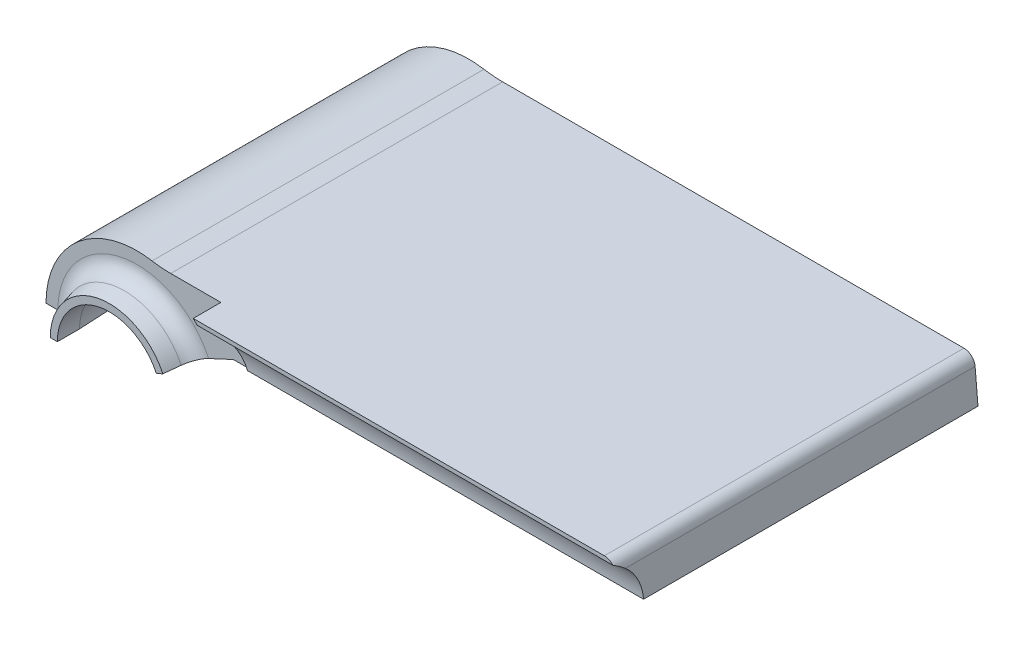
ISO-10303-21;
HEADER;
FILE_DESCRIPTION(('STEP AP214'),'2;1');
FILE_NAME('part.step','',(''),(''),'','','');
FILE_SCHEMA(('AUTOMOTIVE_DESIGN { 1 0 10303 214 1 1 1 1 }'));
ENDSEC;
DATA;
#1=APPLICATION_CONTEXT('core data for automotive mechanical design processes');
#2=APPLICATION_PROTOCOL_DEFINITION('international standard','automotive_design',2000,#1);
#3=PRODUCT_CONTEXT('',#1,'mechanical');
#4=PRODUCT('Part','Part','',(#3));
#5=PRODUCT_RELATED_PRODUCT_CATEGORY('part','',(#4));
#6=PRODUCT_DEFINITION_FORMATION('','',#4);
#7=PRODUCT_DEFINITION_CONTEXT('part definition',#1,'design');
#8=PRODUCT_DEFINITION('design','',#6,#7);
#9=PRODUCT_DEFINITION_SHAPE('','',#8);
#10=(LENGTH_UNIT() NAMED_UNIT(*) SI_UNIT(.MILLI.,.METRE.));
#11=(NAMED_UNIT(*) PLANE_ANGLE_UNIT() SI_UNIT($,.RADIAN.));
#12=(NAMED_UNIT(*) SI_UNIT($,.STERADIAN.) SOLID_ANGLE_UNIT());
#13=UNCERTAINTY_MEASURE_WITH_UNIT(LENGTH_MEASURE(1.E-05),#10,'distance_accuracy_value','');
#14=(GEOMETRIC_REPRESENTATION_CONTEXT(3) GLOBAL_UNCERTAINTY_ASSIGNED_CONTEXT((#13)) GLOBAL_UNIT_ASSIGNED_CONTEXT((#10,
#11,#12)) REPRESENTATION_CONTEXT('',''));
#15=CARTESIAN_POINT('',(0.,0.,0.));
#16=DIRECTION('',(0.,0.,1.));
#17=DIRECTION('',(1.,0.,0.));
#18=AXIS2_PLACEMENT_3D('',#15,#16,#17);
#19=CARTESIAN_POINT('',(6.10080322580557,15.935,65.));
#20=DIRECTION('',(0.,-1.,0.));
#21=DIRECTION('',(0.,0.,-1.));
#22=AXIS2_PLACEMENT_3D('',#19,#20,#21);
#23=PLANE('',#22);
#24=DIRECTION('',(0.,0.,-1.));
#25=VECTOR('',#24,1.);
#26=CARTESIAN_POINT('',(15.1682489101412,15.935,-7.82372390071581));
#27=LINE('',#26,#25);
#28=CARTESIAN_POINT('',(15.1682489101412,15.935,65.));
#29=VERTEX_POINT('',#28);
#30=CARTESIAN_POINT('',(15.1682489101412,15.935,60.));
#31=VERTEX_POINT('',#30);
#32=EDGE_CURVE('E273',#29,#31,#27,.T.);
#33=ORIENTED_EDGE('',*,*,#32,.F.);
#34=DIRECTION('',(-1.,0.,0.));
#35=VECTOR('',#34,1.);
#36=CARTESIAN_POINT('',(6.10080322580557,15.935,65.));
#37=LINE('',#36,#35);
#38=CARTESIAN_POINT('',(89.4898477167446,15.935,65.));
#39=VERTEX_POINT('',#38);
#40=EDGE_CURVE('E295',#39,#29,#37,.T.);
#41=ORIENTED_EDGE('',*,*,#40,.F.);
#42=DIRECTION('',(0.,0.,-1.));
#43=VECTOR('',#42,1.);
#44=CARTESIAN_POINT('',(89.4898477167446,15.935,65.));
#45=LINE('',#44,#43);
#46=CARTESIAN_POINT('',(89.4898477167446,15.935,0.));
#47=VERTEX_POINT('',#46);
#48=EDGE_CURVE('E302',#39,#47,#45,.T.);
#49=ORIENTED_EDGE('',*,*,#48,.T.);
#50=DIRECTION('',(-1.,0.,0.));
#51=VECTOR('',#50,1.);
#52=CARTESIAN_POINT('',(6.10080322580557,15.935,0.));
#53=LINE('',#52,#51);
#54=CARTESIAN_POINT('',(6.10080322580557,15.935,0.));
#55=VERTEX_POINT('',#54);
#56=EDGE_CURVE('E284',#47,#55,#53,.T.);
#57=ORIENTED_EDGE('',*,*,#56,.T.);
#58=DIRECTION('',(0.,0.,-1.));
#59=VECTOR('',#58,1.);
#60=CARTESIAN_POINT('',(6.10080322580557,15.935,65.));
#61=LINE('',#60,#59);
#62=CARTESIAN_POINT('',(6.10080322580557,15.935,60.));
#63=VERTEX_POINT('',#62);
#64=EDGE_CURVE('E300',#63,#55,#61,.T.);
#65=ORIENTED_EDGE('',*,*,#64,.F.);
#66=DIRECTION('',(-1.,0.,0.));
#67=VECTOR('',#66,1.);
#68=CARTESIAN_POINT('',(6.10080322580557,15.935,60.));
#69=LINE('',#68,#67);
#70=EDGE_CURVE('E277',#31,#63,#69,.T.);
#71=ORIENTED_EDGE('',*,*,#70,.F.);
#72=EDGE_LOOP('',(#33,#41,#49,#57,#65,#71));
#73=FACE_BOUND('',#72,.T.);
#74=ADVANCED_FACE('F30',(#73),#23,.F.);
#75=CARTESIAN_POINT('',(6.10080322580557,36.235,65.));
#76=DIRECTION('',(0.,0.,-1.));
#77=DIRECTION('',(-1.,0.,0.));
#78=AXIS2_PLACEMENT_3D('',#75,#76,#77);
#79=CYLINDRICAL_SURFACE('',#78,20.3);
#80=CARTESIAN_POINT('',(6.10080322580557,36.235,60.));
#81=DIRECTION('',(0.,0.,1.));
#82=DIRECTION('',(1.,0.,0.));
#83=AXIS2_PLACEMENT_3D('',#80,#81,#82);
#84=CIRCLE('',#83,20.3);
#85=CARTESIAN_POINT('',(2.73037716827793,16.216752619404,60.));
#86=VERTEX_POINT('',#85);
#87=EDGE_CURVE('E275',#63,#86,#84,.F.);
#88=ORIENTED_EDGE('',*,*,#87,.F.);
#89=ORIENTED_EDGE('',*,*,#64,.T.);
#90=CARTESIAN_POINT('',(6.10080322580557,36.235,0.));
#91=DIRECTION('',(0.,0.,-1.));
#92=DIRECTION('',(1.,0.,0.));
#93=AXIS2_PLACEMENT_3D('',#90,#91,#92);
#94=CIRCLE('',#93,20.3);
#95=CARTESIAN_POINT('',(2.73037716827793,16.216752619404,0.));
#96=VERTEX_POINT('',#95);
#97=EDGE_CURVE('E287',#55,#96,#94,.T.);
#98=ORIENTED_EDGE('',*,*,#97,.T.);
#99=DIRECTION('',(0.,0.,-1.));
#100=VECTOR('',#99,1.);
#101=CARTESIAN_POINT('',(2.73037716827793,16.216752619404,65.));
#102=LINE('',#101,#100);
#103=EDGE_CURVE('E298',#86,#96,#102,.T.);
#104=ORIENTED_EDGE('',*,*,#103,.F.);
#105=EDGE_LOOP('',(#88,#89,#98,#104));
#106=FACE_BOUND('',#105,.T.);
#107=ADVANCED_FACE('F380',(#106),#79,.F.);
#108=CARTESIAN_POINT('',(0.,0.,65.));
#109=DIRECTION('',(0.,0.,-1.));
#110=DIRECTION('',(-1.,0.,0.));
#111=AXIS2_PLACEMENT_3D('',#108,#109,#110);
#112=CYLINDRICAL_SURFACE('',#111,16.445);
#113=CARTESIAN_POINT('',(0.,0.,0.));
#114=DIRECTION('',(0.,0.,1.));
#115=DIRECTION('',(1.,0.,0.));
#116=AXIS2_PLACEMENT_3D('',#113,#114,#115);
#117=CIRCLE('',#116,16.445);
#118=CARTESIAN_POINT('',(-16.445,0.,0.));
#119=VERTEX_POINT('',#118);
#120=EDGE_CURVE('E290',#96,#119,#117,.T.);
#121=ORIENTED_EDGE('',*,*,#120,.T.);
#122=DIRECTION('',(0.,0.,-1.));
#123=VECTOR('',#122,1.);
#124=CARTESIAN_POINT('',(-16.445,0.,65.));
#125=LINE('',#124,#123);
#126=CARTESIAN_POINT('',(-16.445,0.,60.));
#127=VERTEX_POINT('',#126);
#128=EDGE_CURVE('E207',#119,#127,#125,.F.);
#129=ORIENTED_EDGE('',*,*,#128,.T.);
#130=CARTESIAN_POINT('',(0.,0.,60.));
#131=DIRECTION('',(0.,0.,1.));
#132=DIRECTION('',(1.,0.,0.));
#133=AXIS2_PLACEMENT_3D('',#130,#131,#132);
#134=CIRCLE('',#133,16.445);
#135=EDGE_CURVE('E310',#86,#127,#134,.T.);
#136=ORIENTED_EDGE('',*,*,#135,.F.);
#137=ORIENTED_EDGE('',*,*,#103,.T.);
#138=EDGE_LOOP('',(#121,#129,#136,#137));
#139=FACE_BOUND('',#138,.T.);
#140=ADVANCED_FACE('F386',(#139),#112,.T.);
#141=CARTESIAN_POINT('',(30.8284770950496,-19.995,65.));
#142=DIRECTION('',(0.,0.,1.));
#143=DIRECTION('',(1.,0.,0.));
#144=AXIS2_PLACEMENT_3D('',#141,#142,#143);
#145=PLANE('',#144);
#146=DIRECTION('',(1.,0.,0.));
#147=VECTOR('',#146,1.);
#148=CARTESIAN_POINT('',(-16.446,15.2179803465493,65.));
#149=LINE('',#148,#147);
#150=CARTESIAN_POINT('',(15.8875131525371,15.2179803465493,65.));
#151=VERTEX_POINT('',#150);
#152=CARTESIAN_POINT('',(91.0380668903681,15.2179803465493,65.));
#153=VERTEX_POINT('',#152);
#154=EDGE_CURVE('E241',#151,#153,#149,.T.);
#155=ORIENTED_EDGE('',*,*,#154,.T.);
#156=CARTESIAN_POINT('',(89.4898477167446,13.905,65.));
#157=DIRECTION('',(0.,0.,1.));
#158=DIRECTION('',(-1.,0.,0.));
#159=AXIS2_PLACEMENT_3D('',#156,#157,#158);
#160=CIRCLE('',#159,2.03);
#161=EDGE_CURVE('E293',#153,#39,#160,.T.);
#162=ORIENTED_EDGE('',*,*,#161,.T.);
#163=ORIENTED_EDGE('',*,*,#40,.T.);
#164=CARTESIAN_POINT('',(0.,0.,65.));
#165=DIRECTION('',(0.,0.,-1.));
#166=DIRECTION('',(-1.,0.,0.));
#167=AXIS2_PLACEMENT_3D('',#164,#165,#166);
#168=CIRCLE('',#167,22.);
#169=EDGE_CURVE('E270',#29,#151,#168,.T.);
#170=ORIENTED_EDGE('',*,*,#169,.T.);
#171=EDGE_LOOP('',(#155,#162,#163,#170));
#172=FACE_BOUND('',#171,.T.);
#173=ADVANCED_FACE('F401',(#172),#145,.T.);
#174=CARTESIAN_POINT('',(91.5121229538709,14.0819261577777,65.));
#175=DIRECTION('',(-0.996194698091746,-0.0871557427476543,0.));
#176=DIRECTION('',(0.0871557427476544,-0.996194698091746,0.));
#177=AXIS2_PLACEMENT_3D('',#174,#175,#176);
#178=PLANE('',#177);
#179=DIRECTION('',(0.,0.,-1.));
#180=VECTOR('',#179,1.);
#181=CARTESIAN_POINT('',(91.5121229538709,14.0819261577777,65.));
#182=LINE('',#181,#180);
#183=CARTESIAN_POINT('',(91.5121229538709,14.0819261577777,63.2173114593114));
#184=VERTEX_POINT('',#183);
#185=CARTESIAN_POINT('',(91.5121229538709,14.0819261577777,0.));
#186=VERTEX_POINT('',#185);
#187=EDGE_CURVE('E305',#184,#186,#182,.T.);
#188=ORIENTED_EDGE('',*,*,#187,.F.);
#189=CARTESIAN_POINT('',(92.0337239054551,8.12,68.27));
#190=DIRECTION('',(-0.996194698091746,-0.0871557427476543,0.));
#191=DIRECTION('',(0.0871557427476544,-0.996194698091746,0.));
#192=AXIS2_PLACEMENT_3D('',#189,#190,#191);
#193=ELLIPSE('',#192,7.84485203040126,7.815);
#194=CARTESIAN_POINT('',(92.0337239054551,8.12,60.455));
#195=VERTEX_POINT('',#194);
#196=EDGE_CURVE('E238',#195,#184,#193,.F.);
#197=ORIENTED_EDGE('',*,*,#196,.F.);
#198=DIRECTION('',(0.,0.,-1.));
#199=VECTOR('',#198,1.);
#200=CARTESIAN_POINT('',(92.0337239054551,8.12,65.));
#201=LINE('',#200,#199);
#202=CARTESIAN_POINT('',(92.0337239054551,8.12,0.));
#203=VERTEX_POINT('',#202);
#204=EDGE_CURVE('E307',#195,#203,#201,.T.);
#205=ORIENTED_EDGE('',*,*,#204,.T.);
#206=DIRECTION('',(-0.0871557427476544,0.996194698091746,0.));
#207=VECTOR('',#206,1.);
#208=CARTESIAN_POINT('',(91.5121229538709,14.0819261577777,0.));
#209=LINE('',#208,#207);
#210=EDGE_CURVE('E279',#203,#186,#209,.T.);
#211=ORIENTED_EDGE('',*,*,#210,.T.);
#212=EDGE_LOOP('',(#188,#197,#205,#211));
#213=FACE_BOUND('',#212,.T.);
#214=ADVANCED_FACE('F32',(#213),#178,.F.);
#215=CARTESIAN_POINT('',(89.4898477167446,13.905,65.));
#216=DIRECTION('',(0.,0.,-1.));
#217=DIRECTION('',(-1.,0.,0.));
#218=AXIS2_PLACEMENT_3D('',#215,#216,#217);
#219=CYLINDRICAL_SURFACE('',#218,2.03);
#220=ORIENTED_EDGE('',*,*,#161,.F.);
#221=CARTESIAN_POINT('',(89.4898477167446,15.935,68.27));
#222=CARTESIAN_POINT('',(89.4897316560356,15.935,68.2699996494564));
#223=CARTESIAN_POINT('',(89.4896155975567,15.9349999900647,68.2696233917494));
#224=CARTESIAN_POINT('',(89.4892912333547,15.9349999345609,68.2687686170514));
#225=CARTESIAN_POINT('',(89.4890828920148,15.934999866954,68.2684463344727));
#226=CARTESIAN_POINT('',(89.4882889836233,15.9349994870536,68.2670984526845));
#227=CARTESIAN_POINT('',(89.487704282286,15.9349989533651,68.2658570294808));
#228=CARTESIAN_POINT('',(89.4853539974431,15.9349957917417,68.2609940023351));
#229=CARTESIAN_POINT('',(89.4835865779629,15.9349911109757,68.2576248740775));
#230=CARTESIAN_POINT('',(89.4490403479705,15.9348545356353,68.1916066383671));
#231=CARTESIAN_POINT('',(89.4162832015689,15.9339316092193,68.1261074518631));
#232=CARTESIAN_POINT('',(89.3503765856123,15.9304753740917,67.995787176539));
#233=CARTESIAN_POINT('',(89.3172276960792,15.9279207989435,67.9309867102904));
#234=CARTESIAN_POINT('',(89.2523073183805,15.9213080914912,67.8034780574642));
#235=CARTESIAN_POINT('',(89.2205316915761,15.917311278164,67.7407847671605));
#236=CARTESIAN_POINT('',(89.1572384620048,15.9078208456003,67.6157641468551));
#237=CARTESIAN_POINT('',(89.1257203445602,15.902332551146,67.5534363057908));
#238=CARTESIAN_POINT('',(89.024590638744,15.88224235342,67.3528955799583));
#239=CARTESIAN_POINT('',(88.9553515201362,15.8646834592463,67.2147439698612));
#240=CARTESIAN_POINT('',(88.8177318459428,15.8218727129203,66.9376203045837));
#241=CARTESIAN_POINT('',(88.7493649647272,15.7965518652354,66.7986523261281));
#242=CARTESIAN_POINT('',(88.6303020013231,15.7449085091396,66.553356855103));
#243=CARTESIAN_POINT('',(88.5791726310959,15.7201690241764,66.4469061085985));
#244=CARTESIAN_POINT('',(88.4785771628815,15.666103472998,66.2346836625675));
#245=CARTESIAN_POINT('',(88.4291076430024,15.636787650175,66.1289109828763));
#246=CARTESIAN_POINT('',(88.3329926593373,15.574075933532,65.9199702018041));
#247=CARTESIAN_POINT('',(88.286310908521,15.5407709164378,65.8167915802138));
#248=CARTESIAN_POINT('',(88.1950788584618,15.4695523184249,65.6110218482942));
#249=CARTESIAN_POINT('',(88.1505295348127,15.4316366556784,65.508431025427));
#250=CARTESIAN_POINT('',(88.0535826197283,15.3414595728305,65.2794642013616));
#251=CARTESIAN_POINT('',(88.001868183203,15.2879393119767,65.1532903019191));
#252=CARTESIAN_POINT('',(87.9030053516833,15.1733000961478,64.9018619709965));
#253=CARTESIAN_POINT('',(87.8558776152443,15.112149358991,64.7766138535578));
#254=CARTESIAN_POINT('',(87.7656022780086,14.9795166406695,64.5226482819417));
#255=CARTESIAN_POINT('',(87.7227104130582,14.9077051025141,64.3940109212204));
#256=CARTESIAN_POINT('',(87.6447946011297,14.7558537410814,64.1394312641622));
#257=CARTESIAN_POINT('',(87.60976021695,14.6758250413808,64.0134855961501));
#258=CARTESIAN_POINT('',(87.5567116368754,14.5282382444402,63.7954590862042));
#259=CARTESIAN_POINT('',(87.5366306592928,14.4624606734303,63.7026747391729));
#260=CARTESIAN_POINT('',(87.5028057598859,14.326293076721,63.5192954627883));
#261=CARTESIAN_POINT('',(87.4890635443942,14.2559018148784,63.4287011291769));
#262=CARTESIAN_POINT('',(87.4690801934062,14.1115231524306,63.2511535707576));
#263=CARTESIAN_POINT('',(87.4627604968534,14.0375821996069,63.1641717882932));
#264=CARTESIAN_POINT('',(87.4585198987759,13.8858522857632,62.9934268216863));
#265=CARTESIAN_POINT('',(87.4605978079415,13.8080638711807,62.9096631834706));
#266=CARTESIAN_POINT('',(87.477182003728,13.6178632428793,62.7136558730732));
#267=CARTESIAN_POINT('',(87.4962709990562,13.5039058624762,62.603223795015));
#268=CARTESIAN_POINT('',(87.5571595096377,13.2726321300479,62.3921555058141));
#269=CARTESIAN_POINT('',(87.5989668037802,13.1553146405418,62.2915226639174));
#270=CARTESIAN_POINT('',(87.6980890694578,12.9451847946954,62.1213065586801));
#271=CARTESIAN_POINT('',(87.7508160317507,12.8520378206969,62.0494886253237));
#272=CARTESIAN_POINT('',(87.8744232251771,12.6707753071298,61.9156841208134));
#273=CARTESIAN_POINT('',(87.9452923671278,12.5826567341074,61.8536915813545));
#274=CARTESIAN_POINT('',(88.1058534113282,12.415369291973,61.7405028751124));
#275=CARTESIAN_POINT('',(88.1956948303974,12.33627969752,61.6893993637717));
#276=CARTESIAN_POINT('',(88.3921301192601,12.1930868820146,61.5998156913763));
#277=CARTESIAN_POINT('',(88.4987125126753,12.1289734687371,61.5613269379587));
#278=CARTESIAN_POINT('',(88.7092721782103,12.0279542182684,61.5020553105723));
#279=CARTESIAN_POINT('',(88.8115527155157,11.9885054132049,61.4795550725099));
#280=CARTESIAN_POINT('',(89.0227130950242,11.9264219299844,61.4445575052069));
#281=CARTESIAN_POINT('',(89.1315894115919,11.9037783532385,61.432054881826));
#282=CARTESIAN_POINT('',(89.343167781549,11.8777333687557,61.4177112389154));
#283=CARTESIAN_POINT('',(89.4456440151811,11.8729063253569,61.4150800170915));
#284=CARTESIAN_POINT('',(89.6500070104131,11.8787498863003,61.4182821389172));
#285=CARTESIAN_POINT('',(89.7518939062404,11.8894168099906,61.4241134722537));
#286=CARTESIAN_POINT('',(89.9501181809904,11.9253532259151,61.4440263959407));
#287=CARTESIAN_POINT('',(90.0465252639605,11.9503316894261,61.4579436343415));
#288=CARTESIAN_POINT('',(90.2333142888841,12.0134721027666,61.4938351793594));
#289=CARTESIAN_POINT('',(90.3236962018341,12.0516341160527,61.5158095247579));
#290=CARTESIAN_POINT('',(90.4981637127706,12.1403505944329,61.5682312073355));
#291=CARTESIAN_POINT('',(90.5820656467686,12.1911606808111,61.5988553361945));
#292=CARTESIAN_POINT('',(90.7395763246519,12.3023824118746,61.6680166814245));
#293=CARTESIAN_POINT('',(90.8131829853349,12.3627959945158,61.7065554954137));
#294=CARTESIAN_POINT('',(90.9539185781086,12.4952536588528,61.7940370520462));
#295=CARTESIAN_POINT('',(91.0202153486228,12.5678191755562,61.8435245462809));
#296=CARTESIAN_POINT('',(91.1394713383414,12.718046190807,61.9501340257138));
#297=CARTESIAN_POINT('',(91.1924251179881,12.795709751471,62.0072591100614));
#298=CARTESIAN_POINT('',(91.3042031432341,12.9854602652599,62.1527354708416));
#299=CARTESIAN_POINT('',(91.3567251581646,13.0987545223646,62.2443658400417));
#300=CARTESIAN_POINT('',(91.4388563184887,13.3246618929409,62.4383608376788));
#301=CARTESIAN_POINT('',(91.468404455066,13.4372724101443,62.5407532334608));
#302=CARTESIAN_POINT('',(91.501863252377,13.6243332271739,62.7213089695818));
#303=CARTESIAN_POINT('',(91.5108359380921,13.6999813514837,62.7973804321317));
#304=CARTESIAN_POINT('',(91.5204176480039,13.8483384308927,62.9528649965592));
#305=CARTESIAN_POINT('',(91.5210234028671,13.9210462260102,63.0322793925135));
#306=CARTESIAN_POINT('',(91.5119185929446,14.1334950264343,63.2742064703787));
#307=CARTESIAN_POINT('',(91.4913640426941,14.2680892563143,63.4409125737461));
#308=CARTESIAN_POINT('',(91.4363387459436,14.4894884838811,63.7390726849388));
#309=CARTESIAN_POINT('',(91.406635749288,14.5798253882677,63.8689125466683));
#310=CARTESIAN_POINT('',(91.3372829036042,14.7514318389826,64.1320076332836));
#311=CARTESIAN_POINT('',(91.2976269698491,14.8326957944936,64.2652649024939));
#312=CARTESIAN_POINT('',(91.2093103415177,14.9878187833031,64.5373882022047));
#313=CARTESIAN_POINT('',(91.1604659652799,15.0614682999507,64.6763129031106));
#314=CARTESIAN_POINT('',(91.0560720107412,15.1993377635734,64.9561624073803));
#315=CARTESIAN_POINT('',(91.000526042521,15.2635627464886,65.0970860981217));
#316=CARTESIAN_POINT('',(90.8526954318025,15.4149683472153,65.4568820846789));
#317=CARTESIAN_POINT('',(90.7567273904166,15.4959004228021,65.6768866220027));
#318=CARTESIAN_POINT('',(90.5556509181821,15.6370787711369,66.1201110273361));
#319=CARTESIAN_POINT('',(90.450515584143,15.6972614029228,66.3433386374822));
#320=CARTESIAN_POINT('',(90.24448076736,15.7926118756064,66.770479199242));
#321=CARTESIAN_POINT('',(90.1441042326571,15.8295923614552,66.9742467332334));
#322=CARTESIAN_POINT('',(89.9414183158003,15.8869083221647,67.3806144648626));
#323=CARTESIAN_POINT('',(89.8391386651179,15.9074080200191,67.5832056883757));
#324=CARTESIAN_POINT('',(89.7193034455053,15.9220626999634,67.8192570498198));
#325=CARTESIAN_POINT('',(89.7023232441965,15.923921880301,67.8526741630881));
#326=CARTESIAN_POINT('',(89.6679150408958,15.927250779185,67.9203914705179));
#327=CARTESIAN_POINT('',(89.6504863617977,15.928709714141,67.9546930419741));
#328=CARTESIAN_POINT('',(89.6095631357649,15.9316036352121,68.0349679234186));
#329=CARTESIAN_POINT('',(89.5860596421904,15.9328550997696,68.0808664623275));
#330=CARTESIAN_POINT('',(89.5410002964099,15.9344700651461,68.1699304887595));
#331=CARTESIAN_POINT('',(89.5194453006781,15.9348988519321,68.213005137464));
#332=CARTESIAN_POINT('',(89.4961151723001,15.9349910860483,68.2576147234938));
#333=CARTESIAN_POINT('',(89.4943540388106,15.9349957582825,68.2609697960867));
#334=CARTESIAN_POINT('',(89.4920054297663,15.9349989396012,68.2658295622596));
#335=CARTESIAN_POINT('',(89.4914160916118,15.93499948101,68.2670815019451));
#336=CARTESIAN_POINT('',(89.4906161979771,15.9349998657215,68.2684386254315));
#337=CARTESIAN_POINT('',(89.4904065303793,15.934999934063,68.2687625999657));
#338=CARTESIAN_POINT('',(89.4900805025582,15.9349999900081,68.2696226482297));
#339=CARTESIAN_POINT('',(89.48996410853,15.935,68.2700003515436));
#340=CARTESIAN_POINT('',(89.4898477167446,15.935,68.27));
#341=B_SPLINE_CURVE_WITH_KNOTS('',3,(#221,#222,#223,#224,#225,#226,#227,#228,#229,#230,#231,
#232,#233,#234,#235,#236,#237,#238,#239,#240,#241,#242,#243,#244,#245,#246,#247,#248,#249,#250,
#251,#252,#253,#254,#255,#256,#257,#258,#259,#260,#261,#262,#263,#264,#265,#266,#267,#268,#269,
#270,#271,#272,#273,#274,#275,#276,#277,#278,#279,#280,#281,#282,#283,#284,#285,#286,#287,#288,
#289,#290,#291,#292,#293,#294,#295,#296,#297,#298,#299,#300,#301,#302,#303,#304,#305,#306,#307,
#308,#309,#310,#311,#312,#313,#314,#315,#316,#317,#318,#319,#320,#321,#322,#323,#324,#325,#326,
#327,#328,#329,#330,#331,#332,#333,#334,#335,#336,#337,#338,#339,#340),.UNSPECIFIED.,.T.,.F.,(4,
2,2,2,2,2,2,2,2,2,2,2,2,2,2,2,2,2,2,2,2,2,2,2,2,2,2,2,2,2,2,2,2,2,2,2,2,2,2,2,2,2,2,2,2,2,2,2,2,
2,2,2,2,2,2,2,2,2,2,4),(0.,0.000766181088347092,0.00214105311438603,0.00600843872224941,
0.0176805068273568,0.234160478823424,0.453521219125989,0.664482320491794,0.874699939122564,
1.34103016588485,1.81163206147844,2.17350661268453,2.5345824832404,2.88860576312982,
3.24278949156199,3.68199557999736,4.12309624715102,4.58302400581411,5.04233716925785,
5.38856924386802,5.73489446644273,6.07752011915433,6.42009724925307,6.89791947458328,
7.37590541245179,7.76107080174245,8.14600132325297,8.53408686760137,8.92190752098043,
9.25582729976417,9.58957013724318,9.89594534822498,10.2022477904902,10.5025320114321,
10.802817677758,11.1097505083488,11.4167453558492,11.7455584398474,12.0745053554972,
12.5366226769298,12.9999630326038,13.3225111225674,13.6451852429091,14.2883469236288,
14.7706107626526,15.2531701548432,15.7466640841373,16.2398933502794,16.9985775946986,
17.7595685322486,18.4494127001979,19.1322946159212,19.2449063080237,19.3603064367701,
19.5156994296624,19.6581476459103,19.6697780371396,19.6736761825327,19.675059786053,
19.6758281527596),.UNSPECIFIED.);
#342=EDGE_CURVE('E240',#184,#153,#341,.T.);
#343=ORIENTED_EDGE('',*,*,#342,.F.);
#344=ORIENTED_EDGE('',*,*,#187,.T.);
#345=CARTESIAN_POINT('',(89.4898477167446,13.905,0.));
#346=DIRECTION('',(0.,0.,1.));
#347=DIRECTION('',(-1.,0.,0.));
#348=AXIS2_PLACEMENT_3D('',#345,#346,#347);
#349=CIRCLE('',#348,2.03);
#350=EDGE_CURVE('E282',#186,#47,#349,.T.);
#351=ORIENTED_EDGE('',*,*,#350,.T.);
#352=ORIENTED_EDGE('',*,*,#48,.F.);
#353=EDGE_LOOP('',(#220,#343,#344,#351,#352));
#354=FACE_BOUND('',#353,.T.);
#355=ADVANCED_FACE('F391',(#354),#219,.T.);
#356=CARTESIAN_POINT('',(30.8284770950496,-19.995,0.));
#357=DIRECTION('',(0.,0.,1.));
#358=DIRECTION('',(1.,0.,0.));
#359=AXIS2_PLACEMENT_3D('',#356,#357,#358);
#360=PLANE('',#359);
#361=CARTESIAN_POINT('',(0.,0.,0.));
#362=DIRECTION('',(0.,0.,1.));
#363=DIRECTION('',(1.,0.,0.));
#364=AXIS2_PLACEMENT_3D('',#361,#362,#363);
#365=CIRCLE('',#364,12.5868745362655);
#366=CARTESIAN_POINT('',(11.4075824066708,5.31944303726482,0.));
#367=VERTEX_POINT('',#366);
#368=CARTESIAN_POINT('',(-12.5868745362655,0.,0.));
#369=VERTEX_POINT('',#368);
#370=EDGE_CURVE('E231',#367,#369,#365,.T.);
#371=ORIENTED_EDGE('',*,*,#370,.T.);
#372=DIRECTION('',(-1.,0.,0.));
#373=VECTOR('',#372,1.);
#374=CARTESIAN_POINT('',(30.8284770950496,0.,0.));
#375=LINE('',#374,#373);
#376=EDGE_CURVE('E45',#369,#119,#375,.T.);
#377=ORIENTED_EDGE('',*,*,#376,.T.);
#378=ORIENTED_EDGE('',*,*,#120,.F.);
#379=ORIENTED_EDGE('',*,*,#97,.F.);
#380=ORIENTED_EDGE('',*,*,#56,.F.);
#381=ORIENTED_EDGE('',*,*,#350,.F.);
#382=ORIENTED_EDGE('',*,*,#210,.F.);
#383=DIRECTION('',(-1.,0.,0.));
#384=VECTOR('',#383,1.);
#385=CARTESIAN_POINT('',(30.8284770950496,8.12,0.));
#386=LINE('',#385,#384);
#387=CARTESIAN_POINT('',(79.25,8.12,0.));
#388=VERTEX_POINT('',#387);
#389=EDGE_CURVE('E343',#203,#388,#386,.T.);
#390=ORIENTED_EDGE('',*,*,#389,.T.);
#391=CARTESIAN_POINT('',(75.,8.12,0.));
#392=DIRECTION('',(0.,0.,-1.));
#393=DIRECTION('',(-1.,0.,0.));
#394=AXIS2_PLACEMENT_3D('',#391,#392,#393);
#395=CIRCLE('',#394,4.24999999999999);
#396=CARTESIAN_POINT('',(70.75,8.12,0.));
#397=VERTEX_POINT('',#396);
#398=EDGE_CURVE('E219',#397,#388,#395,.T.);
#399=ORIENTED_EDGE('',*,*,#398,.F.);
#400=CARTESIAN_POINT('',(34.25,8.12,0.));
#401=VERTEX_POINT('',#400);
#402=EDGE_CURVE('E340',#397,#401,#386,.T.);
#403=ORIENTED_EDGE('',*,*,#402,.T.);
#404=CARTESIAN_POINT('',(30.,8.12,0.));
#405=DIRECTION('',(0.,0.,-1.));
#406=DIRECTION('',(-1.,0.,0.));
#407=AXIS2_PLACEMENT_3D('',#404,#405,#406);
#408=CIRCLE('',#407,4.25);
#409=CARTESIAN_POINT('',(25.75,8.12,0.));
#410=VERTEX_POINT('',#409);
#411=EDGE_CURVE('E225',#410,#401,#408,.T.);
#412=ORIENTED_EDGE('',*,*,#411,.F.);
#413=CARTESIAN_POINT('',(17.4133961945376,8.12,0.));
#414=VERTEX_POINT('',#413);
#415=EDGE_CURVE('E344',#410,#414,#386,.T.);
#416=ORIENTED_EDGE('',*,*,#415,.T.);
#417=DIRECTION('',(-0.906307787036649,-0.422618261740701,0.));
#418=VECTOR('',#417,1.);
#419=CARTESIAN_POINT('',(17.6637907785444,8.23676091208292,0.));
#420=LINE('',#419,#418);
#421=EDGE_CURVE('E189',#414,#367,#420,.T.);
#422=ORIENTED_EDGE('',*,*,#421,.T.);
#423=EDGE_LOOP('',(#371,#377,#378,#379,#380,#381,#382,#390,#399,#403,#412,#416,#422));
#424=FACE_BOUND('',#423,.T.);
#425=ADVANCED_FACE('F393',(#424),#360,.F.);
#426=CARTESIAN_POINT('',(14.3017483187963,0.,60.));
#427=DIRECTION('',(0.,0.,1.));
#428=DIRECTION('',(1.,0.,0.));
#429=AXIS2_PLACEMENT_3D('',#426,#427,#428);
#430=PLANE('',#429);
#431=DIRECTION('',(-1.,0.,0.));
#432=VECTOR('',#431,1.);
#433=CARTESIAN_POINT('',(14.3017483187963,0.,60.));
#434=LINE('',#433,#432);
#435=CARTESIAN_POINT('',(-14.3017483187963,0.,60.));
#436=VERTEX_POINT('',#435);
#437=EDGE_CURVE('E210',#436,#127,#434,.T.);
#438=ORIENTED_EDGE('',*,*,#437,.F.);
#439=CARTESIAN_POINT('',(0.,0.,60.));
#440=DIRECTION('',(0.,0.,-1.));
#441=DIRECTION('',(-1.,0.,0.));
#442=AXIS2_PLACEMENT_3D('',#439,#440,#441);
#443=CIRCLE('',#442,14.3017483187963);
#444=CARTESIAN_POINT('',(12.9617858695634,6.04418001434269,60.));
#445=VERTEX_POINT('',#444);
#446=EDGE_CURVE('E196',#436,#445,#443,.T.);
#447=ORIENTED_EDGE('',*,*,#446,.T.);
#448=DIRECTION('',(-0.906307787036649,-0.422618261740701,0.));
#449=VECTOR('',#448,1.);
#450=CARTESIAN_POINT('',(11.7473674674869,5.47788741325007,60.));
#451=LINE('',#450,#449);
#452=CARTESIAN_POINT('',(17.4133961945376,8.12,60.));
#453=VERTEX_POINT('',#452);
#454=EDGE_CURVE('E186',#453,#445,#451,.T.);
#455=ORIENTED_EDGE('',*,*,#454,.F.);
#456=DIRECTION('',(-1.,0.,0.));
#457=VECTOR('',#456,1.);
#458=CARTESIAN_POINT('',(14.3017483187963,8.12,60.));
#459=LINE('',#458,#457);
#460=CARTESIAN_POINT('',(20.4466525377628,8.12,60.));
#461=VERTEX_POINT('',#460);
#462=EDGE_CURVE('E171',#461,#453,#459,.T.);
#463=ORIENTED_EDGE('',*,*,#462,.F.);
#464=CARTESIAN_POINT('',(0.,0.,60.));
#465=DIRECTION('',(0.,0.,-1.));
#466=DIRECTION('',(-1.,0.,0.));
#467=AXIS2_PLACEMENT_3D('',#464,#465,#466);
#468=CIRCLE('',#467,22.);
#469=EDGE_CURVE('E268',#31,#461,#468,.T.);
#470=ORIENTED_EDGE('',*,*,#469,.F.);
#471=ORIENTED_EDGE('',*,*,#70,.T.);
#472=ORIENTED_EDGE('',*,*,#87,.T.);
#473=ORIENTED_EDGE('',*,*,#135,.T.);
#474=EDGE_LOOP('',(#438,#447,#455,#463,#470,#471,#472,#473));
#475=FACE_BOUND('',#474,.T.);
#476=ADVANCED_FACE('F194',(#475),#430,.T.);
#477=CARTESIAN_POINT('',(0.,0.,-7.82372390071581));
#478=DIRECTION('',(0.,0.,-1.));
#479=DIRECTION('',(-1.,0.,0.));
#480=AXIS2_PLACEMENT_3D('',#477,#478,#479);
#481=CYLINDRICAL_SURFACE('',#480,22.);
#482=DIRECTION('',(0.,0.,-1.));
#483=VECTOR('',#482,1.);
#484=CARTESIAN_POINT('',(20.4466525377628,8.12,-7.82372390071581));
#485=LINE('',#484,#483);
#486=CARTESIAN_POINT('',(20.4466525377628,8.12,60.455));
#487=VERTEX_POINT('',#486);
#488=EDGE_CURVE('E177',#487,#461,#485,.T.);
#489=ORIENTED_EDGE('',*,*,#488,.F.);
#490=CARTESIAN_POINT('',(20.4466525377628,8.12,60.455));
#491=CARTESIAN_POINT('',(20.3510161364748,8.36081444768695,60.4550012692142));
#492=CARTESIAN_POINT('',(20.251106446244,8.59996062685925,60.4661399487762));
#493=CARTESIAN_POINT('',(20.0436542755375,9.07296381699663,60.5096823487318));
#494=CARTESIAN_POINT('',(19.9361099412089,9.30681952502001,60.5420912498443));
#495=CARTESIAN_POINT('',(19.7143688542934,9.76775861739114,60.6270900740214));
#496=CARTESIAN_POINT('',(19.6001682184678,9.99483792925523,60.6796918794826));
#497=CARTESIAN_POINT('',(19.366248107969,10.4408758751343,60.8039843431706));
#498=CARTESIAN_POINT('',(19.2465264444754,10.6598312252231,60.8756826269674));
#499=CARTESIAN_POINT('',(19.0035339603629,11.0871888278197,61.0366165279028));
#500=CARTESIAN_POINT('',(18.8802891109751,11.2956470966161,61.1257429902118));
#501=CARTESIAN_POINT('',(18.6307896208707,11.7025913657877,61.3208857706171));
#502=CARTESIAN_POINT('',(18.5045350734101,11.9010776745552,61.4269015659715));
#503=CARTESIAN_POINT('',(18.250160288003,12.2876049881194,61.6551883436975));
#504=CARTESIAN_POINT('',(18.1220380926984,12.4756338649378,61.7774776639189));
#505=CARTESIAN_POINT('',(17.8655012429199,12.8403099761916,62.0375805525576));
#506=CARTESIAN_POINT('',(17.737086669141,13.0169600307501,62.1753902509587));
#507=CARTESIAN_POINT('',(17.4669484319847,13.377669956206,62.4826470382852));
#508=CARTESIAN_POINT('',(17.3253678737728,13.5602963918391,62.6539096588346));
#509=CARTESIAN_POINT('',(17.0460886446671,13.9097414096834,63.014882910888));
#510=CARTESIAN_POINT('',(16.9083909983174,14.0765558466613,63.2045983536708));
#511=CARTESIAN_POINT('',(16.6399937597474,14.392829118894,63.6020032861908));
#512=CARTESIAN_POINT('',(16.5092831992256,14.5423156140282,63.8096631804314));
#513=CARTESIAN_POINT('',(16.2582115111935,14.8224811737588,64.242898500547));
#514=CARTESIAN_POINT('',(16.1378438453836,14.9531721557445,64.4684624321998));
#515=CARTESIAN_POINT('',(15.8821697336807,15.2249742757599,64.9983817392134));
#516=CARTESIAN_POINT('',(15.7510556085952,15.3600329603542,65.3080234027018));
#517=CARTESIAN_POINT('',(15.5793608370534,15.5335183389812,65.7914282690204));
#518=CARTESIAN_POINT('',(15.5262970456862,15.5864915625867,65.9556986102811));
#519=CARTESIAN_POINT('',(15.4298210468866,15.6820030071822,66.2899736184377));
#520=CARTESIAN_POINT('',(15.3864038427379,15.7245466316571,66.4599752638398));
#521=CARTESIAN_POINT('',(15.3100868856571,15.7988646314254,66.8067627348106));
#522=CARTESIAN_POINT('',(15.2773117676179,15.8305116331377,66.9836035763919));
#523=CARTESIAN_POINT('',(15.224122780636,15.8816704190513,67.3408868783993));
#524=CARTESIAN_POINT('',(15.203708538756,15.9011825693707,67.5213292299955));
#525=CARTESIAN_POINT('',(15.1760549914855,15.9275775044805,67.8840080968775));
#526=CARTESIAN_POINT('',(15.1688055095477,15.9344700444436,68.0662431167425));
#527=CARTESIAN_POINT('',(15.1677543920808,15.9354708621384,68.4307771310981));
#528=CARTESIAN_POINT('',(15.1739512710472,15.9295805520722,68.6130761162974));
#529=CARTESIAN_POINT('',(15.1976443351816,15.906973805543,68.9492236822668));
#530=CARTESIAN_POINT('',(15.2133485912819,15.8919732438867,69.1033208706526));
#531=CARTESIAN_POINT('',(15.2538950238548,15.8530589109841,69.4092099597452));
#532=CARTESIAN_POINT('',(15.278739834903,15.8291425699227,69.5610011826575));
#533=CARTESIAN_POINT('',(15.336913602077,15.7727840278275,69.8613782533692));
#534=CARTESIAN_POINT('',(15.3702453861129,15.7403389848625,70.0099630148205));
#535=CARTESIAN_POINT('',(15.4445913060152,15.6673963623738,70.3031927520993));
#536=CARTESIAN_POINT('',(15.4856072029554,15.6268969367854,70.4478368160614));
#537=CARTESIAN_POINT('',(15.589827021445,15.5230285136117,70.7819048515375));
#538=CARTESIAN_POINT('',(15.6557991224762,15.4565939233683,70.969518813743));
#539=CARTESIAN_POINT('',(15.7979670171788,15.3112561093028,71.3357629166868));
#540=CARTESIAN_POINT('',(15.8741633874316,15.2323521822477,71.5143925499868));
#541=CARTESIAN_POINT('',(16.0349680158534,15.0629829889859,71.8625989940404));
#542=CARTESIAN_POINT('',(16.1195923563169,14.9724955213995,72.0321575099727));
#543=CARTESIAN_POINT('',(16.2953600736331,14.7810061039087,72.3616424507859));
#544=CARTESIAN_POINT('',(16.3865036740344,14.6800037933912,72.5215685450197));
#545=CARTESIAN_POINT('',(16.6037295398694,14.4343661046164,72.8813377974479));
#546=CARTESIAN_POINT('',(16.7316655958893,14.2861049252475,73.0775953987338));
#547=CARTESIAN_POINT('',(16.9932443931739,13.973945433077,73.4531648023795));
#548=CARTESIAN_POINT('',(17.1268888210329,13.810042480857,73.6324715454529));
#549=CARTESIAN_POINT('',(17.3974424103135,13.4676141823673,73.9740109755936));
#550=CARTESIAN_POINT('',(17.5343529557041,13.2890825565,74.1362362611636));
#551=CARTESIAN_POINT('',(17.809248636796,12.9183558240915,74.4431604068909));
#552=CARTESIAN_POINT('',(17.9472336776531,12.7261619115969,74.5878607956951));
#553=CARTESIAN_POINT('',(18.2240125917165,12.3266014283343,74.8607452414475));
#554=CARTESIAN_POINT('',(18.3627975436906,12.1190859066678,74.9887204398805));
#555=CARTESIAN_POINT('',(18.6378203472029,11.6917157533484,75.2253375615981));
#556=CARTESIAN_POINT('',(18.7740583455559,11.471861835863,75.3339806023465));
#557=CARTESIAN_POINT('',(19.0423393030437,11.0208051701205,75.5308598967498));
#558=CARTESIAN_POINT('',(19.1743832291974,10.7896050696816,75.6191008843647));
#559=CARTESIAN_POINT('',(19.4327689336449,10.3169768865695,75.7739553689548));
#560=CARTESIAN_POINT('',(19.5591108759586,10.0755490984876,75.8405694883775));
#561=CARTESIAN_POINT('',(19.804356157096,9.58449829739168,75.9506657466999));
#562=CARTESIAN_POINT('',(19.9232761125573,9.33489564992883,75.994201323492));
#563=CARTESIAN_POINT('',(20.1526573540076,8.828792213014,76.0569664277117));
#564=CARTESIAN_POINT('',(20.2631184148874,8.57229124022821,76.0761953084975));
#565=CARTESIAN_POINT('',(20.4742825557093,8.05492025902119,76.0890076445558));
#566=CARTESIAN_POINT('',(20.5749946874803,7.79405457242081,76.0826151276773));
#567=CARTESIAN_POINT('',(20.7657862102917,7.27046781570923,76.0431204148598));
#568=CARTESIAN_POINT('',(20.8558677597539,7.00774713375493,76.0100236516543));
#569=CARTESIAN_POINT('',(21.012640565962,6.52109398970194,75.9230904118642));
#570=CARTESIAN_POINT('',(21.080834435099,6.29698905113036,75.8728980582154));
#571=CARTESIAN_POINT('',(21.2087104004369,5.85185441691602,75.7521719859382));
#572=CARTESIAN_POINT('',(21.2683934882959,5.63082436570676,75.6816406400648));
#573=CARTESIAN_POINT('',(21.3792237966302,5.19418094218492,75.5203760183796));
#574=CARTESIAN_POINT('',(21.4303750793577,4.97856503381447,75.4296524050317));
#575=CARTESIAN_POINT('',(21.5244024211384,4.5549070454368,75.2283992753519));
#576=CARTESIAN_POINT('',(21.5672789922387,4.3468644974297,75.1178709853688));
#577=CARTESIAN_POINT('',(21.6413000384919,3.96091020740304,74.8897663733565));
#578=CARTESIAN_POINT('',(21.673189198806,3.78206668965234,74.7740023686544));
#579=CARTESIAN_POINT('',(21.7310846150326,3.43381958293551,74.5277479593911));
#580=CARTESIAN_POINT('',(21.7570911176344,3.26441559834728,74.3972581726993));
#581=CARTESIAN_POINT('',(21.8037736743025,2.93647615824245,74.1224415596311));
#582=CARTESIAN_POINT('',(21.8244502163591,2.77793970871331,73.9781160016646));
#583=CARTESIAN_POINT('',(21.8611041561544,2.47299727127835,73.6766216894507));
#584=CARTESIAN_POINT('',(21.877081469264,2.32659150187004,73.5194527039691));
#585=CARTESIAN_POINT('',(21.9048540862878,2.0485794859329,73.1951597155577));
#586=CARTESIAN_POINT('',(21.916692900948,1.9168298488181,73.0281622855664));
#587=CARTESIAN_POINT('',(21.9370905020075,1.66725737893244,72.6837934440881));
#588=CARTESIAN_POINT('',(21.9456481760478,1.54943927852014,72.5064185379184));
#589=CARTESIAN_POINT('',(21.9601219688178,1.3286413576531,72.1425894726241));
#590=CARTESIAN_POINT('',(21.9660383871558,1.22565985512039,71.9561363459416));
#591=CARTESIAN_POINT('',(21.9758362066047,1.03523757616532,71.5754007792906));
#592=CARTESIAN_POINT('',(21.979717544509,0.947797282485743,71.3811180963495));
#593=CARTESIAN_POINT('',(21.9860539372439,0.787409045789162,70.9819292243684));
#594=CARTESIAN_POINT('',(21.9884776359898,0.714800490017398,70.7768861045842));
#595=CARTESIAN_POINT('',(21.9922627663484,0.586919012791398,70.3614479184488));
#596=CARTESIAN_POINT('',(21.9936241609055,0.531646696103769,70.1510526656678));
#597=CARTESIAN_POINT('',(21.9956718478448,0.438835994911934,69.7264226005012));
#598=CARTESIAN_POINT('',(21.996358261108,0.401294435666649,69.5121884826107));
#599=CARTESIAN_POINT('',(21.9973261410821,0.34418039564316,69.0812451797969));
#600=CARTESIAN_POINT('',(21.9976074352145,0.324615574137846,68.864534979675));
#601=CARTESIAN_POINT('',(21.9979088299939,0.303515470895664,68.4280952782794));
#602=CARTESIAN_POINT('',(21.9979263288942,0.302159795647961,68.2083570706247));
#603=CARTESIAN_POINT('',(21.9977037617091,0.317947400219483,67.7696386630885));
#604=CARTESIAN_POINT('',(21.9974638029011,0.335082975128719,67.550658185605));
#605=CARTESIAN_POINT('',(21.9965988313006,0.387726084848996,67.1148591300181));
#606=CARTESIAN_POINT('',(21.9959737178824,0.423238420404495,66.8980411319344));
#607=CARTESIAN_POINT('',(21.994077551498,0.512384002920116,66.4681713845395));
#608=CARTESIAN_POINT('',(21.9928065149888,0.566016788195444,66.2551195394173));
#609=CARTESIAN_POINT('',(21.9892322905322,0.691068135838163,65.8341326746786));
#610=CARTESIAN_POINT('',(21.9869283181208,0.762500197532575,65.6262016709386));
#611=CARTESIAN_POINT('',(21.980791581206,0.922613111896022,65.2171174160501));
#612=CARTESIAN_POINT('',(21.9769588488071,1.01129360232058,65.0159640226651));
#613=CARTESIAN_POINT('',(21.9671740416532,1.20527683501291,64.6218389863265));
#614=CARTESIAN_POINT('',(21.9612215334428,1.31058297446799,64.4288690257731));
#615=CARTESIAN_POINT('',(21.9465386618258,1.5369764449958,64.0526301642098));
#616=CARTESIAN_POINT('',(21.9378093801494,1.65805761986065,63.8693575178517));
#617=CARTESIAN_POINT('',(21.9169185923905,1.91445339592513,63.5146813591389));
#618=CARTESIAN_POINT('',(21.904774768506,2.04969247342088,63.3432222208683));
#619=CARTESIAN_POINT('',(21.8763232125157,2.33385170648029,63.0124095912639));
#620=CARTESIAN_POINT('',(21.8600154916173,2.4827718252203,62.853056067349));
#621=CARTESIAN_POINT('',(21.82253858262,2.7930664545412,62.5476415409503));
#622=CARTESIAN_POINT('',(21.8013701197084,2.95443910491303,62.4015785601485));
#623=CARTESIAN_POINT('',(21.7535161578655,3.28830719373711,62.1237712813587));
#624=CARTESIAN_POINT('',(21.7268307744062,3.46080239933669,61.9920266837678));
#625=CARTESIAN_POINT('',(21.6679504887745,3.8119530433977,61.7461983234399));
#626=CARTESIAN_POINT('',(21.6358738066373,3.99042151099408,61.6318190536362));
#627=CARTESIAN_POINT('',(21.5654227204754,4.35511492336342,61.4183942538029));
#628=CARTESIAN_POINT('',(21.5270483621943,4.54133981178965,61.3193486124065));
#629=CARTESIAN_POINT('',(21.4436968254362,4.9198999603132,61.1371394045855));
#630=CARTESIAN_POINT('',(21.3987217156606,5.11223329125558,61.0539708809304));
#631=CARTESIAN_POINT('',(21.3019799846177,5.5014406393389,60.9038017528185));
#632=CARTESIAN_POINT('',(21.2502136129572,5.69831448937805,60.836800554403));
#633=CARTESIAN_POINT('',(21.1440076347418,6.0800658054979,60.723510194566));
#634=CARTESIAN_POINT('',(21.0900614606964,6.2647326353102,60.6760427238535));
#635=CARTESIAN_POINT('',(20.9763951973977,6.63539233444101,60.5949646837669));
#636=CARTESIAN_POINT('',(20.9166732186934,6.82138561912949,60.5613586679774));
#637=CARTESIAN_POINT('',(20.7916447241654,7.19347129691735,60.5078417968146));
#638=CARTESIAN_POINT('',(20.7263378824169,7.37956369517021,60.4879317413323));
#639=CARTESIAN_POINT('',(20.5904048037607,7.75076260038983,60.4615094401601));
#640=CARTESIAN_POINT('',(20.519777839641,7.93586896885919,60.4549990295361));
#641=CARTESIAN_POINT('',(20.4466525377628,8.12,60.455));
#642=B_SPLINE_CURVE_WITH_KNOTS('',3,(#490,#491,#492,#493,#494,#495,#496,#497,#498,#499,#500,
#501,#502,#503,#504,#505,#506,#507,#508,#509,#510,#511,#512,#513,#514,#515,#516,#517,#518,#519,
#520,#521,#522,#523,#524,#525,#526,#527,#528,#529,#530,#531,#532,#533,#534,#535,#536,#537,#538,
#539,#540,#541,#542,#543,#544,#545,#546,#547,#548,#549,#550,#551,#552,#553,#554,#555,#556,#557,
#558,#559,#560,#561,#562,#563,#564,#565,#566,#567,#568,#569,#570,#571,#572,#573,#574,#575,#576,
#577,#578,#579,#580,#581,#582,#583,#584,#585,#586,#587,#588,#589,#590,#591,#592,#593,#594,#595,
#596,#597,#598,#599,#600,#601,#602,#603,#604,#605,#606,#607,#608,#609,#610,#611,#612,#613,#614,
#615,#616,#617,#618,#619,#620,#621,#622,#623,#624,#625,#626,#627,#628,#629,#630,#631,#632,#633,
#634,#635,#636,#637,#638,#639,#640,#641),.UNSPECIFIED.,.T.,.F.,(4,2,2,2,2,2,2,2,2,2,2,2,2,2,2,2,
2,2,2,2,2,2,2,2,2,2,2,2,2,2,2,2,2,2,2,2,2,2,2,2,2,2,2,2,2,2,2,2,2,2,2,2,2,2,2,2,2,2,2,2,2,2,2,2,
2,2,2,2,2,2,2,2,2,2,2,4),(0.,0.777120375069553,1.55443010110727,2.3321979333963,
3.11027680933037,3.88363014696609,4.65695955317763,5.43116788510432,6.20518359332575,
7.06702164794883,7.9290850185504,8.78975279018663,9.64987242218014,10.7325285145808,
11.2737215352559,11.8146335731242,12.3616693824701,12.9086886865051,13.4552849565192,
14.001820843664,14.4681399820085,14.9345936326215,15.4012029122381,15.8679192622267,
16.496015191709,17.1241465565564,17.7535003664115,18.3828757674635,19.2134756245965,
20.0443226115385,20.875528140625,21.7066611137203,22.547343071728,23.3879764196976,
24.2284145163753,25.0688284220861,25.9072877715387,26.7457694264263,27.5834649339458,
28.4209900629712,29.1387061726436,29.8563385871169,30.5736283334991,31.2908736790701,
31.9363396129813,32.5817784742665,33.2271582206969,33.8725495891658,34.5109356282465,
35.1495378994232,35.7880677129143,36.4266173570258,37.0784529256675,37.7303112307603,
38.3820527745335,39.0340718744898,39.6925175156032,40.3506889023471,41.0090323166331,
41.6673589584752,42.3261864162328,42.9850000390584,43.6439484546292,44.302640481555,
44.9579823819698,45.6133225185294,46.2685649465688,46.9237936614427,47.5661816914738,
48.208565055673,48.8507475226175,49.4929063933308,50.0867955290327,50.680879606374,
51.2749983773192,51.8691985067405),.UNSPECIFIED.);
#643=EDGE_CURVE('E237',#487,#151,#642,.T.);
#644=ORIENTED_EDGE('',*,*,#643,.T.);
#645=ORIENTED_EDGE('',*,*,#169,.F.);
#646=ORIENTED_EDGE('',*,*,#32,.T.);
#647=ORIENTED_EDGE('',*,*,#469,.T.);
#648=EDGE_LOOP('',(#489,#644,#645,#646,#647));
#649=FACE_BOUND('',#648,.T.);
#650=ADVANCED_FACE('F370',(#649),#481,.F.);
#651=CARTESIAN_POINT('',(0.,0.,63.04));
#652=DIRECTION('',(0.,0.,-1.));
#653=DIRECTION('',(-1.,0.,0.));
#654=AXIS2_PLACEMENT_3D('',#651,#652,#653);
#655=TOROIDAL_SURFACE('',#654,14.3017483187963,3.04);
#656=CARTESIAN_POINT('',(-14.3017483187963,0.,63.04));
#657=DIRECTION('',(0.,1.,0.));
#658=DIRECTION('',(0.,0.,1.));
#659=AXIS2_PLACEMENT_3D('',#656,#657,#658);
#660=CIRCLE('',#659,3.04);
#661=CARTESIAN_POINT('',(-11.3520493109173,0.,62.3045574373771));
#662=VERTEX_POINT('',#661);
#663=EDGE_CURVE('E212',#662,#436,#660,.T.);
#664=ORIENTED_EDGE('',*,*,#663,.F.);
#665=CARTESIAN_POINT('',(0.,0.,62.3045574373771));
#666=DIRECTION('',(0.,0.,-1.));
#667=DIRECTION('',(-1.,0.,0.));
#668=AXIS2_PLACEMENT_3D('',#665,#666,#667);
#669=CIRCLE('',#668,11.3520493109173);
#670=CARTESIAN_POINT('',(10.2884506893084,4.79758334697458,62.3045574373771));
#671=VERTEX_POINT('',#670);
#672=EDGE_CURVE('E264',#662,#671,#669,.T.);
#673=ORIENTED_EDGE('',*,*,#672,.T.);
#674=CARTESIAN_POINT('',(12.9617858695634,6.04418001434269,63.04));
#675=DIRECTION('',(-0.422618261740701,0.906307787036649,0.));
#676=DIRECTION('',(-0.906307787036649,-0.422618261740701,0.));
#677=AXIS2_PLACEMENT_3D('',#674,#675,#676);
#678=CIRCLE('',#677,3.04);
#679=EDGE_CURVE('E198',#445,#671,#678,.T.);
#680=ORIENTED_EDGE('',*,*,#679,.F.);
#681=ORIENTED_EDGE('',*,*,#446,.F.);
#682=EDGE_LOOP('',(#664,#673,#680,#681));
#683=FACE_BOUND('',#682,.T.);
#684=ADVANCED_FACE('F368',(#683),#655,.F.);
#685=CARTESIAN_POINT('',(0.,0.,62.3045574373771));
#686=DIRECTION('',(0.,0.,-1.));
#687=DIRECTION('',(-1.,0.,0.));
#688=AXIS2_PLACEMENT_3D('',#685,#686,#687);
#689=CONICAL_SURFACE('',#688,11.3520493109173,0.244346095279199);
#690=DIRECTION('',(0.241921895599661,0.,0.970295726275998));
#691=VECTOR('',#690,1.);
#692=CARTESIAN_POINT('',(0.,0.,107.835140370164));
#693=LINE('',#692,#691);
#694=CARTESIAN_POINT('',(-10.68,0.,65.));
#695=VERTEX_POINT('',#694);
#696=EDGE_CURVE('E214',#695,#662,#693,.F.);
#697=ORIENTED_EDGE('',*,*,#696,.F.);
#698=CARTESIAN_POINT('',(0.,0.,65.));
#699=DIRECTION('',(0.,0.,-1.));
#700=DIRECTION('',(-1.,0.,0.));
#701=AXIS2_PLACEMENT_3D('',#698,#699,#700);
#702=CIRCLE('',#701,10.68);
#703=CARTESIAN_POINT('',(9.67936716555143,4.51356303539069,65.));
#704=VERTEX_POINT('',#703);
#705=EDGE_CURVE('E248',#695,#704,#702,.T.);
#706=ORIENTED_EDGE('',*,*,#705,.T.);
#707=DIRECTION('',(0.21925569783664,0.102240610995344,-0.970295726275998));
#708=VECTOR('',#707,1.);
#709=CARTESIAN_POINT('',(0.,0.,107.835140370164));
#710=LINE('',#709,#708);
#711=EDGE_CURVE('E202',#671,#704,#710,.F.);
#712=ORIENTED_EDGE('',*,*,#711,.F.);
#713=ORIENTED_EDGE('',*,*,#672,.F.);
#714=EDGE_LOOP('',(#697,#706,#712,#713));
#715=FACE_BOUND('',#714,.T.);
#716=ADVANCED_FACE('F365',(#715),#689,.T.);
#717=DIRECTION('',(1.,0.,0.));
#718=VECTOR('',#717,1.);
#719=CARTESIAN_POINT('',(-21.0076453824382,0.,65.));
#720=LINE('',#719,#718);
#721=CARTESIAN_POINT('',(-9.39,0.,65.));
#722=VERTEX_POINT('',#721);
#723=EDGE_CURVE('E327',#695,#722,#720,.T.);
#724=ORIENTED_EDGE('',*,*,#723,.T.);
#725=CARTESIAN_POINT('',(0.,0.,65.));
#726=DIRECTION('',(0.,0.,1.));
#727=DIRECTION('',(1.,0.,0.));
#728=AXIS2_PLACEMENT_3D('',#725,#726,#727);
#729=CIRCLE('',#728,9.39);
#730=CARTESIAN_POINT('',(8.51023012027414,3.96838547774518,65.));
#731=VERTEX_POINT('',#730);
#732=EDGE_CURVE('E234',#731,#722,#729,.T.);
#733=ORIENTED_EDGE('',*,*,#732,.F.);
#734=DIRECTION('',(0.906307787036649,0.422618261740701,0.));
#735=VECTOR('',#734,1.);
#736=CARTESIAN_POINT('',(0.,0.,65.));
#737=LINE('',#736,#735);
#738=EDGE_CURVE('E190',#731,#704,#737,.T.);
#739=ORIENTED_EDGE('',*,*,#738,.T.);
#740=ORIENTED_EDGE('',*,*,#705,.F.);
#741=EDGE_LOOP('',(#724,#733,#739,#740));
#742=FACE_BOUND('',#741,.T.);
#743=ADVANCED_FACE('F331',(#742),#145,.T.);
#744=CARTESIAN_POINT('',(-16.446,8.12,68.27));
#745=DIRECTION('',(1.,0.,0.));
#746=DIRECTION('',(0.,0.,-1.));
#747=AXIS2_PLACEMENT_3D('',#744,#745,#746);
#748=CYLINDRICAL_SURFACE('',#747,7.815);
#749=ORIENTED_EDGE('',*,*,#643,.F.);
#750=DIRECTION('',(1.,0.,0.));
#751=VECTOR('',#750,1.);
#752=CARTESIAN_POINT('',(-16.446,8.12,60.455));
#753=LINE('',#752,#751);
#754=EDGE_CURVE('E357',#487,#195,#753,.T.);
#755=ORIENTED_EDGE('',*,*,#754,.T.);
#756=ORIENTED_EDGE('',*,*,#196,.T.);
#757=ORIENTED_EDGE('',*,*,#342,.T.);
#758=ORIENTED_EDGE('',*,*,#154,.F.);
#759=EDGE_LOOP('',(#749,#755,#756,#757,#758));
#760=FACE_BOUND('',#759,.T.);
#761=ADVANCED_FACE('F250',(#760),#748,.F.);
#762=CARTESIAN_POINT('',(0.,0.,61.));
#763=DIRECTION('',(0.,0.,1.));
#764=DIRECTION('',(1.,0.,0.));
#765=AXIS2_PLACEMENT_3D('',#762,#763,#764);
#766=CYLINDRICAL_SURFACE('',#765,9.39);
#767=ORIENTED_EDGE('',*,*,#732,.T.);
#768=DIRECTION('',(0.,0.,1.));
#769=VECTOR('',#768,1.);
#770=CARTESIAN_POINT('',(-9.39,0.,61.));
#771=LINE('',#770,#769);
#772=CARTESIAN_POINT('',(-9.39,0.,61.));
#773=VERTEX_POINT('',#772);
#774=EDGE_CURVE('E197',#722,#773,#771,.F.);
#775=ORIENTED_EDGE('',*,*,#774,.T.);
#776=CARTESIAN_POINT('',(0.,0.,61.));
#777=DIRECTION('',(0.,0.,1.));
#778=DIRECTION('',(1.,0.,0.));
#779=AXIS2_PLACEMENT_3D('',#776,#777,#778);
#780=CIRCLE('',#779,9.39);
#781=CARTESIAN_POINT('',(8.51023012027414,3.96838547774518,61.));
#782=VERTEX_POINT('',#781);
#783=EDGE_CURVE('E228',#782,#773,#780,.T.);
#784=ORIENTED_EDGE('',*,*,#783,.F.);
#785=DIRECTION('',(0.,0.,1.));
#786=VECTOR('',#785,1.);
#787=CARTESIAN_POINT('',(8.51023012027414,3.96838547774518,61.));
#788=LINE('',#787,#786);
#789=EDGE_CURVE('E182',#782,#731,#788,.T.);
#790=ORIENTED_EDGE('',*,*,#789,.T.);
#791=EDGE_LOOP('',(#767,#775,#784,#790));
#792=FACE_BOUND('',#791,.T.);
#793=ADVANCED_FACE('F256',(#792),#766,.F.);
#794=CARTESIAN_POINT('',(0.,0.,61.));
#795=DIRECTION('',(0.,0.,-1.));
#796=DIRECTION('',(1.,0.,0.));
#797=AXIS2_PLACEMENT_3D('',#794,#795,#796);
#798=CONICAL_SURFACE('',#797,9.39,0.05235987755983);
#799=ORIENTED_EDGE('',*,*,#783,.T.);
#800=DIRECTION('',(0.0523359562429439,0.,0.998629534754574));
#801=VECTOR('',#800,1.);
#802=CARTESIAN_POINT('',(0.,0.,240.171873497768));
#803=LINE('',#802,#801);
#804=EDGE_CURVE('E11',#773,#369,#803,.F.);
#805=ORIENTED_EDGE('',*,*,#804,.T.);
#806=ORIENTED_EDGE('',*,*,#370,.F.);
#807=DIRECTION('',(0.0474324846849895,0.0221181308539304,-0.998629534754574));
#808=VECTOR('',#807,1.);
#809=CARTESIAN_POINT('',(0.,0.,240.171873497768));
#810=LINE('',#809,#808);
#811=EDGE_CURVE('E38',#367,#782,#810,.F.);
#812=ORIENTED_EDGE('',*,*,#811,.T.);
#813=EDGE_LOOP('',(#799,#805,#806,#812));
#814=FACE_BOUND('',#813,.T.);
#815=ADVANCED_FACE('F321',(#814),#798,.F.);
#816=CARTESIAN_POINT('',(30.,8.12,0.));
#817=DIRECTION('',(0.,0.,-1.));
#818=DIRECTION('',(-1.,0.,0.));
#819=AXIS2_PLACEMENT_3D('',#816,#817,#818);
#820=CYLINDRICAL_SURFACE('',#819,4.24999999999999);
#821=ORIENTED_EDGE('',*,*,#411,.T.);
#822=DIRECTION('',(0.,0.,-1.));
#823=VECTOR('',#822,1.);
#824=CARTESIAN_POINT('',(34.25,8.12,0.));
#825=LINE('',#824,#823);
#826=CARTESIAN_POINT('',(34.25,8.12,48.));
#827=VERTEX_POINT('',#826);
#828=EDGE_CURVE('E345',#401,#827,#825,.F.);
#829=ORIENTED_EDGE('',*,*,#828,.T.);
#830=CARTESIAN_POINT('',(30.,8.12,48.));
#831=DIRECTION('',(0.,0.,-1.));
#832=DIRECTION('',(-1.,0.,0.));
#833=AXIS2_PLACEMENT_3D('',#830,#831,#832);
#834=CIRCLE('',#833,4.24999999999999);
#835=CARTESIAN_POINT('',(25.75,8.12,48.));
#836=VERTEX_POINT('',#835);
#837=EDGE_CURVE('E222',#836,#827,#834,.T.);
#838=ORIENTED_EDGE('',*,*,#837,.F.);
#839=DIRECTION('',(0.,0.,-1.));
#840=VECTOR('',#839,1.);
#841=CARTESIAN_POINT('',(25.75,8.12,0.));
#842=LINE('',#841,#840);
#843=EDGE_CURVE('E354',#836,#410,#842,.T.);
#844=ORIENTED_EDGE('',*,*,#843,.T.);
#845=EDGE_LOOP('',(#821,#829,#838,#844));
#846=FACE_BOUND('',#845,.T.);
#847=ADVANCED_FACE('F447',(#846),#820,.F.);
#848=CARTESIAN_POINT('',(30.,8.12,48.));
#849=DIRECTION('',(0.,0.,-1.));
#850=DIRECTION('',(-1.,0.,0.));
#851=AXIS2_PLACEMENT_3D('',#848,#849,#850);
#852=CONICAL_SURFACE('',#851,4.24999999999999,1.0471975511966);
#853=ORIENTED_EDGE('',*,*,#837,.T.);
#854=DIRECTION('',(0.866025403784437,0.,-0.500000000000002));
#855=VECTOR('',#854,1.);
#856=CARTESIAN_POINT('',(30.,8.12,50.4537386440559));
#857=LINE('',#856,#855);
#858=CARTESIAN_POINT('',(30.,8.12,50.4537386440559));
#859=VERTEX_POINT('',#858);
#860=EDGE_CURVE('E348',#827,#859,#857,.F.);
#861=ORIENTED_EDGE('',*,*,#860,.T.);
#862=DIRECTION('',(0.866025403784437,0.,0.500000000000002));
#863=VECTOR('',#862,1.);
#864=CARTESIAN_POINT('',(30.,8.12,50.4537386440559));
#865=LINE('',#864,#863);
#866=EDGE_CURVE('E351',#859,#836,#865,.F.);
#867=ORIENTED_EDGE('',*,*,#866,.T.);
#868=EDGE_LOOP('',(#853,#861,#867));
#869=FACE_BOUND('',#868,.T.);
#870=ADVANCED_FACE('F440',(#869),#852,.F.);
#871=CARTESIAN_POINT('',(75.,8.12,0.));
#872=DIRECTION('',(0.,0.,-1.));
#873=DIRECTION('',(-1.,0.,0.));
#874=AXIS2_PLACEMENT_3D('',#871,#872,#873);
#875=CYLINDRICAL_SURFACE('',#874,4.24999999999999);
#876=ORIENTED_EDGE('',*,*,#398,.T.);
#877=DIRECTION('',(0.,0.,-1.));
#878=VECTOR('',#877,1.);
#879=CARTESIAN_POINT('',(79.25,8.12,0.));
#880=LINE('',#879,#878);
#881=CARTESIAN_POINT('',(79.25,8.12,48.));
#882=VERTEX_POINT('',#881);
#883=EDGE_CURVE('E334',#388,#882,#880,.F.);
#884=ORIENTED_EDGE('',*,*,#883,.T.);
#885=CARTESIAN_POINT('',(75.,8.12,48.));
#886=DIRECTION('',(0.,0.,-1.));
#887=DIRECTION('',(-1.,0.,0.));
#888=AXIS2_PLACEMENT_3D('',#885,#886,#887);
#889=CIRCLE('',#888,4.24999999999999);
#890=CARTESIAN_POINT('',(70.75,8.12,48.));
#891=VERTEX_POINT('',#890);
#892=EDGE_CURVE('E216',#891,#882,#889,.T.);
#893=ORIENTED_EDGE('',*,*,#892,.F.);
#894=DIRECTION('',(0.,0.,-1.));
#895=VECTOR('',#894,1.);
#896=CARTESIAN_POINT('',(70.75,8.12,0.));
#897=LINE('',#896,#895);
#898=EDGE_CURVE('E52',#891,#397,#897,.T.);
#899=ORIENTED_EDGE('',*,*,#898,.T.);
#900=EDGE_LOOP('',(#876,#884,#893,#899));
#901=FACE_BOUND('',#900,.T.);
#902=ADVANCED_FACE('F429',(#901),#875,.F.);
#903=CARTESIAN_POINT('',(75.,8.12,48.));
#904=DIRECTION('',(0.,0.,-1.));
#905=DIRECTION('',(-1.,0.,0.));
#906=AXIS2_PLACEMENT_3D('',#903,#904,#905);
#907=CONICAL_SURFACE('',#906,4.24999999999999,1.0471975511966);
#908=ORIENTED_EDGE('',*,*,#892,.T.);
#909=DIRECTION('',(0.866025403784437,0.,-0.500000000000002));
#910=VECTOR('',#909,1.);
#911=CARTESIAN_POINT('',(75.,8.12,50.4537386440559));
#912=LINE('',#911,#910);
#913=CARTESIAN_POINT('',(75.,8.12,50.4537386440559));
#914=VERTEX_POINT('',#913);
#915=EDGE_CURVE('E315',#882,#914,#912,.F.);
#916=ORIENTED_EDGE('',*,*,#915,.T.);
#917=DIRECTION('',(0.866025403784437,0.,0.500000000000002));
#918=VECTOR('',#917,1.);
#919=CARTESIAN_POINT('',(75.,8.12,50.4537386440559));
#920=LINE('',#919,#918);
#921=EDGE_CURVE('E313',#914,#891,#920,.F.);
#922=ORIENTED_EDGE('',*,*,#921,.T.);
#923=EDGE_LOOP('',(#908,#916,#922));
#924=FACE_BOUND('',#923,.T.);
#925=ADVANCED_FACE('F432',(#924),#907,.F.);
#926=CARTESIAN_POINT('',(17.4133961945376,8.12,65.));
#927=DIRECTION('',(0.,1.,0.));
#928=DIRECTION('',(0.,0.,1.));
#929=AXIS2_PLACEMENT_3D('',#926,#927,#928);
#930=PLANE('',#929);
#931=ORIENTED_EDGE('',*,*,#488,.T.);
#932=ORIENTED_EDGE('',*,*,#462,.T.);
#933=DIRECTION('',(0.,0.,-1.));
#934=VECTOR('',#933,1.);
#935=CARTESIAN_POINT('',(17.4133961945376,8.12,65.));
#936=LINE('',#935,#934);
#937=EDGE_CURVE('E174',#453,#414,#936,.T.);
#938=ORIENTED_EDGE('',*,*,#937,.T.);
#939=ORIENTED_EDGE('',*,*,#415,.F.);
#940=ORIENTED_EDGE('',*,*,#843,.F.);
#941=ORIENTED_EDGE('',*,*,#866,.F.);
#942=ORIENTED_EDGE('',*,*,#860,.F.);
#943=ORIENTED_EDGE('',*,*,#828,.F.);
#944=ORIENTED_EDGE('',*,*,#402,.F.);
#945=ORIENTED_EDGE('',*,*,#898,.F.);
#946=ORIENTED_EDGE('',*,*,#921,.F.);
#947=ORIENTED_EDGE('',*,*,#915,.F.);
#948=ORIENTED_EDGE('',*,*,#883,.F.);
#949=ORIENTED_EDGE('',*,*,#389,.F.);
#950=ORIENTED_EDGE('',*,*,#204,.F.);
#951=ORIENTED_EDGE('',*,*,#754,.F.);
#952=EDGE_LOOP('',(#931,#932,#938,#939,#940,#941,#942,#943,#944,#945,#946,#947,#948,#949,#950,#951));
#953=FACE_BOUND('',#952,.T.);
#954=ADVANCED_FACE('F173',(#953),#930,.F.);
#955=CARTESIAN_POINT('',(0.,0.,65.));
#956=DIRECTION('',(-0.422618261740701,0.906307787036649,0.));
#957=DIRECTION('',(-0.906307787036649,-0.422618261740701,0.));
#958=AXIS2_PLACEMENT_3D('',#955,#956,#957);
#959=PLANE('',#958);
#960=ORIENTED_EDGE('',*,*,#937,.F.);
#961=ORIENTED_EDGE('',*,*,#454,.T.);
#962=ORIENTED_EDGE('',*,*,#679,.T.);
#963=ORIENTED_EDGE('',*,*,#711,.T.);
#964=ORIENTED_EDGE('',*,*,#738,.F.);
#965=ORIENTED_EDGE('',*,*,#789,.F.);
#966=ORIENTED_EDGE('',*,*,#811,.F.);
#967=ORIENTED_EDGE('',*,*,#421,.F.);
#968=EDGE_LOOP('',(#960,#961,#962,#963,#964,#965,#966,#967));
#969=FACE_BOUND('',#968,.T.);
#970=ADVANCED_FACE('F185',(#969),#959,.F.);
#971=CARTESIAN_POINT('',(-21.0076453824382,0.,65.));
#972=DIRECTION('',(0.,1.,0.));
#973=DIRECTION('',(0.,0.,1.));
#974=AXIS2_PLACEMENT_3D('',#971,#972,#973);
#975=PLANE('',#974);
#976=ORIENTED_EDGE('',*,*,#723,.F.);
#977=ORIENTED_EDGE('',*,*,#696,.T.);
#978=ORIENTED_EDGE('',*,*,#663,.T.);
#979=ORIENTED_EDGE('',*,*,#437,.T.);
#980=ORIENTED_EDGE('',*,*,#128,.F.);
#981=ORIENTED_EDGE('',*,*,#376,.F.);
#982=ORIENTED_EDGE('',*,*,#804,.F.);
#983=ORIENTED_EDGE('',*,*,#774,.F.);
#984=EDGE_LOOP('',(#976,#977,#978,#979,#980,#981,#982,#983));
#985=FACE_BOUND('',#984,.T.);
#986=ADVANCED_FACE('F326',(#985),#975,.F.);
#987=CLOSED_SHELL('',(#74,#107,#140,#173,#214,#355,#425,#476,#650,#684,#716,#743,#761,#793,#815,
#847,#870,#902,#925,#954,#970,#986));
#988=MANIFOLD_SOLID_BREP('B2',#987);
#989=ADVANCED_BREP_SHAPE_REPRESENTATION('',(#18,#988),#14);
#990=SHAPE_DEFINITION_REPRESENTATION(#9,#989);
ENDSEC;
END-ISO-10303-21;
